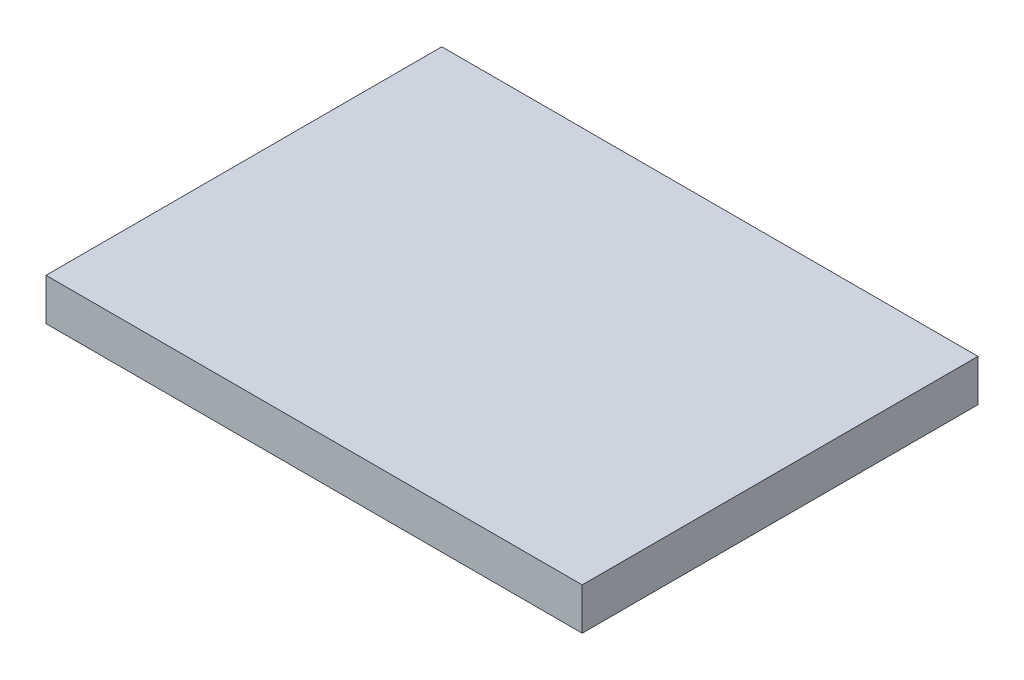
ISO-10303-21;
HEADER;
FILE_DESCRIPTION(('STEP AP214'),'2;1');
FILE_NAME('part.step','',(''),(''),'','','');
FILE_SCHEMA(('AUTOMOTIVE_DESIGN { 1 0 10303 214 1 1 1 1 }'));
ENDSEC;
DATA;
#1=APPLICATION_CONTEXT('core data for automotive mechanical design processes');
#2=APPLICATION_PROTOCOL_DEFINITION('international standard','automotive_design',2000,#1);
#3=PRODUCT_CONTEXT('',#1,'mechanical');
#4=PRODUCT('Part','Part','',(#3));
#5=PRODUCT_RELATED_PRODUCT_CATEGORY('part','',(#4));
#6=PRODUCT_DEFINITION_FORMATION('','',#4);
#7=PRODUCT_DEFINITION_CONTEXT('part definition',#1,'design');
#8=PRODUCT_DEFINITION('design','',#6,#7);
#9=PRODUCT_DEFINITION_SHAPE('','',#8);
#10=(LENGTH_UNIT() NAMED_UNIT(*) SI_UNIT(.MILLI.,.METRE.));
#11=(NAMED_UNIT(*) PLANE_ANGLE_UNIT() SI_UNIT($,.RADIAN.));
#12=(NAMED_UNIT(*) SI_UNIT($,.STERADIAN.) SOLID_ANGLE_UNIT());
#13=UNCERTAINTY_MEASURE_WITH_UNIT(LENGTH_MEASURE(1.E-05),#10,'distance_accuracy_value','');
#14=(GEOMETRIC_REPRESENTATION_CONTEXT(3) GLOBAL_UNCERTAINTY_ASSIGNED_CONTEXT((#13)) GLOBAL_UNIT_ASSIGNED_CONTEXT((#10,
#11,#12)) REPRESENTATION_CONTEXT('',''));
#15=CARTESIAN_POINT('',(0.,0.,0.));
#16=DIRECTION('',(0.,0.,1.));
#17=DIRECTION('',(1.,0.,0.));
#18=AXIS2_PLACEMENT_3D('',#15,#16,#17);
#19=CARTESIAN_POINT('',(32.,5.,23.622));
#20=DIRECTION('',(0.,0.,-1.));
#21=DIRECTION('',(-1.,0.,0.));
#22=AXIS2_PLACEMENT_3D('',#19,#20,#21);
#23=PLANE('',#22);
#24=DIRECTION('',(1.,0.,0.));
#25=VECTOR('',#24,1.);
#26=CARTESIAN_POINT('',(32.,0.,23.622));
#27=LINE('',#26,#25);
#28=CARTESIAN_POINT('',(-32.,0.,23.622));
#29=VERTEX_POINT('',#28);
#30=CARTESIAN_POINT('',(32.,0.,23.622));
#31=VERTEX_POINT('',#30);
#32=EDGE_CURVE('E107',#29,#31,#27,.T.);
#33=ORIENTED_EDGE('',*,*,#32,.T.);
#34=DIRECTION('',(0.,-1.,0.));
#35=VECTOR('',#34,1.);
#36=CARTESIAN_POINT('',(32.,5.,23.622));
#37=LINE('',#36,#35);
#38=CARTESIAN_POINT('',(32.,5.,23.622));
#39=VERTEX_POINT('',#38);
#40=EDGE_CURVE('E11',#39,#31,#37,.T.);
#41=ORIENTED_EDGE('',*,*,#40,.F.);
#42=DIRECTION('',(1.,0.,0.));
#43=VECTOR('',#42,1.);
#44=CARTESIAN_POINT('',(32.,5.,23.622));
#45=LINE('',#44,#43);
#46=CARTESIAN_POINT('',(-32.,5.,23.622));
#47=VERTEX_POINT('',#46);
#48=EDGE_CURVE('E91',#47,#39,#45,.T.);
#49=ORIENTED_EDGE('',*,*,#48,.F.);
#50=DIRECTION('',(0.,-1.,0.));
#51=VECTOR('',#50,1.);
#52=CARTESIAN_POINT('',(-32.,5.,23.622));
#53=LINE('',#52,#51);
#54=EDGE_CURVE('E103',#47,#29,#53,.T.);
#55=ORIENTED_EDGE('',*,*,#54,.T.);
#56=EDGE_LOOP('',(#33,#41,#49,#55));
#57=FACE_BOUND('',#56,.T.);
#58=ADVANCED_FACE('F39',(#57),#23,.F.);
#59=CARTESIAN_POINT('',(32.,5.,-23.622));
#60=DIRECTION('',(-1.,0.,0.));
#61=DIRECTION('',(0.,0.,1.));
#62=AXIS2_PLACEMENT_3D('',#59,#60,#61);
#63=PLANE('',#62);
#64=DIRECTION('',(0.,0.,-1.));
#65=VECTOR('',#64,1.);
#66=CARTESIAN_POINT('',(32.,0.,-23.622));
#67=LINE('',#66,#65);
#68=CARTESIAN_POINT('',(32.,0.,-23.622));
#69=VERTEX_POINT('',#68);
#70=EDGE_CURVE('E96',#31,#69,#67,.T.);
#71=ORIENTED_EDGE('',*,*,#70,.T.);
#72=DIRECTION('',(0.,-1.,0.));
#73=VECTOR('',#72,1.);
#74=CARTESIAN_POINT('',(32.,5.,-23.622));
#75=LINE('',#74,#73);
#76=CARTESIAN_POINT('',(32.,5.,-23.622));
#77=VERTEX_POINT('',#76);
#78=EDGE_CURVE('E48',#77,#69,#75,.T.);
#79=ORIENTED_EDGE('',*,*,#78,.F.);
#80=DIRECTION('',(0.,0.,-1.));
#81=VECTOR('',#80,1.);
#82=CARTESIAN_POINT('',(32.,5.,-23.622));
#83=LINE('',#82,#81);
#84=EDGE_CURVE('E86',#39,#77,#83,.T.);
#85=ORIENTED_EDGE('',*,*,#84,.F.);
#86=ORIENTED_EDGE('',*,*,#40,.T.);
#87=EDGE_LOOP('',(#71,#79,#85,#86));
#88=FACE_BOUND('',#87,.T.);
#89=ADVANCED_FACE('F95',(#88),#63,.F.);
#90=CARTESIAN_POINT('',(-32.,5.,-23.622));
#91=DIRECTION('',(0.,0.,1.));
#92=DIRECTION('',(1.,0.,0.));
#93=AXIS2_PLACEMENT_3D('',#90,#91,#92);
#94=PLANE('',#93);
#95=DIRECTION('',(-1.,0.,0.));
#96=VECTOR('',#95,1.);
#97=CARTESIAN_POINT('',(-32.,0.,-23.622));
#98=LINE('',#97,#96);
#99=CARTESIAN_POINT('',(-32.,0.,-23.622));
#100=VERTEX_POINT('',#99);
#101=EDGE_CURVE('E73',#69,#100,#98,.T.);
#102=ORIENTED_EDGE('',*,*,#101,.T.);
#103=DIRECTION('',(0.,-1.,0.));
#104=VECTOR('',#103,1.);
#105=CARTESIAN_POINT('',(-32.,5.,-23.622));
#106=LINE('',#105,#104);
#107=CARTESIAN_POINT('',(-32.,5.,-23.622));
#108=VERTEX_POINT('',#107);
#109=EDGE_CURVE('E98',#108,#100,#106,.T.);
#110=ORIENTED_EDGE('',*,*,#109,.F.);
#111=DIRECTION('',(-1.,0.,0.));
#112=VECTOR('',#111,1.);
#113=CARTESIAN_POINT('',(-32.,5.,-23.622));
#114=LINE('',#113,#112);
#115=EDGE_CURVE('E89',#77,#108,#114,.T.);
#116=ORIENTED_EDGE('',*,*,#115,.F.);
#117=ORIENTED_EDGE('',*,*,#78,.T.);
#118=EDGE_LOOP('',(#102,#110,#116,#117));
#119=FACE_BOUND('',#118,.T.);
#120=ADVANCED_FACE('F99',(#119),#94,.F.);
#121=CARTESIAN_POINT('',(-32.,5.,23.622));
#122=DIRECTION('',(1.,0.,0.));
#123=DIRECTION('',(0.,0.,-1.));
#124=AXIS2_PLACEMENT_3D('',#121,#122,#123);
#125=PLANE('',#124);
#126=DIRECTION('',(0.,0.,1.));
#127=VECTOR('',#126,1.);
#128=CARTESIAN_POINT('',(-32.,0.,23.622));
#129=LINE('',#128,#127);
#130=EDGE_CURVE('E79',#100,#29,#129,.T.);
#131=ORIENTED_EDGE('',*,*,#130,.T.);
#132=ORIENTED_EDGE('',*,*,#54,.F.);
#133=DIRECTION('',(0.,0.,1.));
#134=VECTOR('',#133,1.);
#135=CARTESIAN_POINT('',(-32.,5.,23.622));
#136=LINE('',#135,#134);
#137=EDGE_CURVE('E56',#108,#47,#136,.T.);
#138=ORIENTED_EDGE('',*,*,#137,.F.);
#139=ORIENTED_EDGE('',*,*,#109,.T.);
#140=EDGE_LOOP('',(#131,#132,#138,#139));
#141=FACE_BOUND('',#140,.T.);
#142=ADVANCED_FACE('F120',(#141),#125,.F.);
#143=CARTESIAN_POINT('',(0.,5.,0.));
#144=DIRECTION('',(0.,-1.,0.));
#145=DIRECTION('',(0.,0.,-1.));
#146=AXIS2_PLACEMENT_3D('',#143,#144,#145);
#147=PLANE('',#146);
#148=ORIENTED_EDGE('',*,*,#48,.T.);
#149=ORIENTED_EDGE('',*,*,#84,.T.);
#150=ORIENTED_EDGE('',*,*,#115,.T.);
#151=ORIENTED_EDGE('',*,*,#137,.T.);
#152=EDGE_LOOP('',(#148,#149,#150,#151));
#153=FACE_BOUND('',#152,.T.);
#154=ADVANCED_FACE('F87',(#153),#147,.F.);
#155=CARTESIAN_POINT('',(0.,0.,0.));
#156=DIRECTION('',(0.,-1.,0.));
#157=DIRECTION('',(0.,0.,-1.));
#158=AXIS2_PLACEMENT_3D('',#155,#156,#157);
#159=PLANE('',#158);
#160=ORIENTED_EDGE('',*,*,#32,.F.);
#161=ORIENTED_EDGE('',*,*,#130,.F.);
#162=ORIENTED_EDGE('',*,*,#101,.F.);
#163=ORIENTED_EDGE('',*,*,#70,.F.);
#164=EDGE_LOOP('',(#160,#161,#162,#163));
#165=FACE_BOUND('',#164,.T.);
#166=ADVANCED_FACE('F123',(#165),#159,.T.);
#167=CLOSED_SHELL('',(#58,#89,#120,#142,#154,#166));
#168=MANIFOLD_SOLID_BREP('B2',#167);
#169=ADVANCED_BREP_SHAPE_REPRESENTATION('',(#18,#168),#14);
#170=SHAPE_DEFINITION_REPRESENTATION(#9,#169);
ENDSEC;
END-ISO-10303-21;
